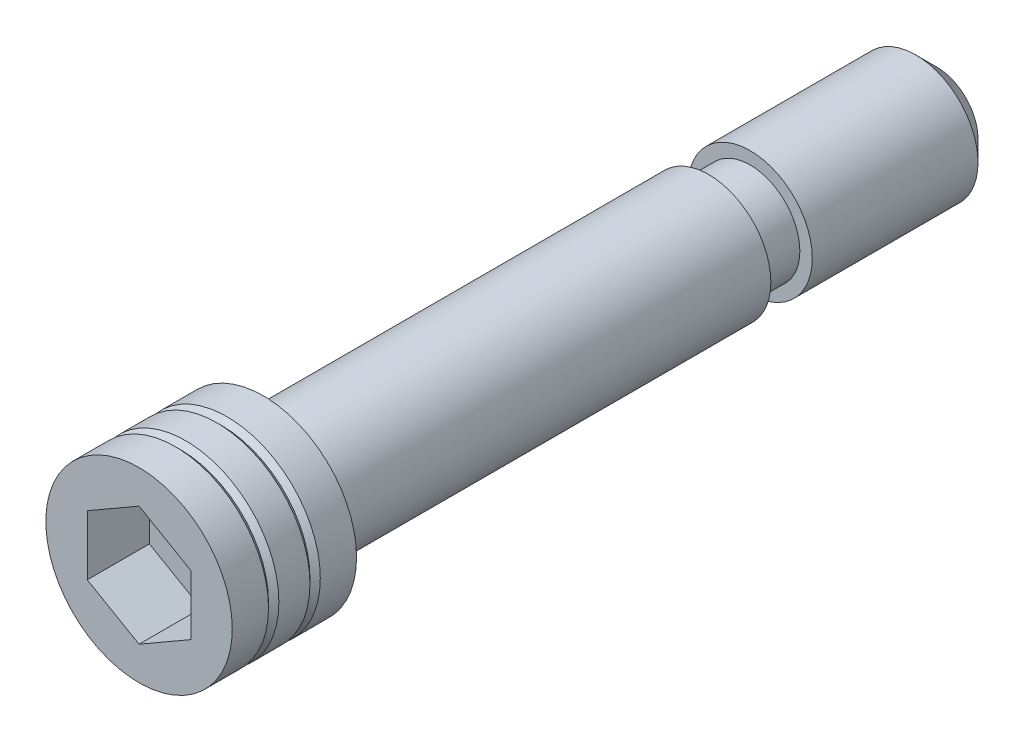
ISO-10303-21;
HEADER;
FILE_DESCRIPTION(('STEP AP214'),'2;1');
FILE_NAME('part.step','',(''),(''),'','','');
FILE_SCHEMA(('AUTOMOTIVE_DESIGN { 1 0 10303 214 1 1 1 1 }'));
ENDSEC;
DATA;
#1=APPLICATION_CONTEXT('core data for automotive mechanical design processes');
#2=APPLICATION_PROTOCOL_DEFINITION('international standard','automotive_design',2000,#1);
#3=PRODUCT_CONTEXT('',#1,'mechanical');
#4=PRODUCT('Part','Part','',(#3));
#5=PRODUCT_RELATED_PRODUCT_CATEGORY('part','',(#4));
#6=PRODUCT_DEFINITION_FORMATION('','',#4);
#7=PRODUCT_DEFINITION_CONTEXT('part definition',#1,'design');
#8=PRODUCT_DEFINITION('design','',#6,#7);
#9=PRODUCT_DEFINITION_SHAPE('','',#8);
#10=(LENGTH_UNIT() NAMED_UNIT(*) SI_UNIT(.MILLI.,.METRE.));
#11=(NAMED_UNIT(*) PLANE_ANGLE_UNIT() SI_UNIT($,.RADIAN.));
#12=(NAMED_UNIT(*) SI_UNIT($,.STERADIAN.) SOLID_ANGLE_UNIT());
#13=UNCERTAINTY_MEASURE_WITH_UNIT(LENGTH_MEASURE(1.E-05),#10,'distance_accuracy_value','');
#14=(GEOMETRIC_REPRESENTATION_CONTEXT(3) GLOBAL_UNCERTAINTY_ASSIGNED_CONTEXT((#13)) GLOBAL_UNIT_ASSIGNED_CONTEXT((#10,
#11,#12)) REPRESENTATION_CONTEXT('',''));
#15=CARTESIAN_POINT('',(0.,0.,0.));
#16=DIRECTION('',(0.,0.,1.));
#17=DIRECTION('',(1.,0.,0.));
#18=AXIS2_PLACEMENT_3D('',#15,#16,#17);
#19=CARTESIAN_POINT('',(0.,0.,15.));
#20=DIRECTION('',(0.,0.,1.));
#21=DIRECTION('',(1.,0.,0.));
#22=AXIS2_PLACEMENT_3D('',#19,#20,#21);
#23=CYLINDRICAL_SURFACE('',#22,9.);
#24=CARTESIAN_POINT('',(0.,0.,0.));
#25=DIRECTION('',(0.,0.,1.));
#26=DIRECTION('',(1.,0.,0.));
#27=AXIS2_PLACEMENT_3D('',#24,#25,#26);
#28=CIRCLE('',#27,9.);
#29=CARTESIAN_POINT('',(9.,0.,0.));
#30=VERTEX_POINT('',#29);
#31=EDGE_CURVE('E128',#30,#30,#28,.T.);
#32=ORIENTED_EDGE('',*,*,#31,.T.);
#33=EDGE_LOOP('',(#32));
#34=FACE_BOUND('',#33,.T.);
#35=CARTESIAN_POINT('',(0.,0.,3.5));
#36=DIRECTION('',(0.,0.,-1.));
#37=DIRECTION('',(-1.,0.,0.));
#38=AXIS2_PLACEMENT_3D('',#35,#36,#37);
#39=CIRCLE('',#38,9.);
#40=CARTESIAN_POINT('',(-9.,0.,3.5));
#41=VERTEX_POINT('',#40);
#42=EDGE_CURVE('E18',#41,#41,#39,.F.);
#43=ORIENTED_EDGE('',*,*,#42,.F.);
#44=EDGE_LOOP('',(#43));
#45=FACE_BOUND('',#44,.T.);
#46=ADVANCED_FACE('F14',(#34,#45),#23,.T.);
#47=CARTESIAN_POINT('',(0.,0.,-65.));
#48=DIRECTION('',(0.,0.,1.));
#49=DIRECTION('',(1.,0.,0.));
#50=AXIS2_PLACEMENT_3D('',#47,#48,#49);
#51=PLANE('',#50);
#52=CARTESIAN_POINT('',(0.,0.,-65.));
#53=DIRECTION('',(0.,0.,1.));
#54=DIRECTION('',(1.,0.,0.));
#55=AXIS2_PLACEMENT_3D('',#52,#53,#54);
#56=CIRCLE('',#55,4.);
#57=CARTESIAN_POINT('',(4.,0.,-65.));
#58=VERTEX_POINT('',#57);
#59=EDGE_CURVE('E9',#58,#58,#56,.T.);
#60=ORIENTED_EDGE('',*,*,#59,.F.);
#61=EDGE_LOOP('',(#60));
#62=FACE_BOUND('',#61,.T.);
#63=ADVANCED_FACE('F16',(#62),#51,.F.);
#64=CARTESIAN_POINT('',(0.,0.,-65.));
#65=DIRECTION('',(0.,0.,1.));
#66=DIRECTION('',(1.,0.,0.));
#67=AXIS2_PLACEMENT_3D('',#64,#65,#66);
#68=CONICAL_SURFACE('',#67,4.,0.785398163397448);
#69=CARTESIAN_POINT('',(0.,0.,-63.));
#70=DIRECTION('',(0.,0.,1.));
#71=DIRECTION('',(1.,0.,0.));
#72=AXIS2_PLACEMENT_3D('',#69,#70,#71);
#73=CIRCLE('',#72,6.);
#74=CARTESIAN_POINT('',(6.,0.,-63.));
#75=VERTEX_POINT('',#74);
#76=EDGE_CURVE('E23',#75,#75,#73,.T.);
#77=ORIENTED_EDGE('',*,*,#76,.F.);
#78=EDGE_LOOP('',(#77));
#79=FACE_BOUND('',#78,.T.);
#80=ORIENTED_EDGE('',*,*,#59,.T.);
#81=EDGE_LOOP('',(#80));
#82=FACE_BOUND('',#81,.T.);
#83=ADVANCED_FACE('F283',(#79,#82),#68,.T.);
#84=CARTESIAN_POINT('',(0.,0.,15.));
#85=DIRECTION('',(0.,0.,1.));
#86=DIRECTION('',(1.,0.,0.));
#87=AXIS2_PLACEMENT_3D('',#84,#85,#86);
#88=CYLINDRICAL_SURFACE('',#87,6.);
#89=CARTESIAN_POINT('',(0.,0.,-47.));
#90=DIRECTION('',(0.,0.,1.));
#91=DIRECTION('',(1.,0.,0.));
#92=AXIS2_PLACEMENT_3D('',#89,#90,#91);
#93=CIRCLE('',#92,6.);
#94=CARTESIAN_POINT('',(6.,0.,-47.));
#95=VERTEX_POINT('',#94);
#96=EDGE_CURVE('E143',#95,#95,#93,.T.);
#97=ORIENTED_EDGE('',*,*,#96,.F.);
#98=EDGE_LOOP('',(#97));
#99=FACE_BOUND('',#98,.T.);
#100=ORIENTED_EDGE('',*,*,#76,.T.);
#101=EDGE_LOOP('',(#100));
#102=FACE_BOUND('',#101,.T.);
#103=ADVANCED_FACE('F292',(#99,#102),#88,.T.);
#104=CARTESIAN_POINT('',(-6.,0.,-47.));
#105=DIRECTION('',(0.,0.,-1.));
#106=DIRECTION('',(-1.,0.,0.));
#107=AXIS2_PLACEMENT_3D('',#104,#105,#106);
#108=PLANE('',#107);
#109=CARTESIAN_POINT('',(0.,0.,-47.));
#110=DIRECTION('',(0.,0.,1.));
#111=DIRECTION('',(1.,0.,0.));
#112=AXIS2_PLACEMENT_3D('',#109,#110,#111);
#113=CIRCLE('',#112,4.8);
#114=CARTESIAN_POINT('',(4.8,0.,-47.));
#115=VERTEX_POINT('',#114);
#116=EDGE_CURVE('E140',#115,#115,#113,.T.);
#117=ORIENTED_EDGE('',*,*,#116,.F.);
#118=EDGE_LOOP('',(#117));
#119=FACE_BOUND('',#118,.T.);
#120=ORIENTED_EDGE('',*,*,#96,.T.);
#121=EDGE_LOOP('',(#120));
#122=FACE_BOUND('',#121,.T.);
#123=ADVANCED_FACE('F301',(#119,#122),#108,.F.);
#124=CARTESIAN_POINT('',(0.,0.,15.));
#125=DIRECTION('',(0.,0.,1.));
#126=DIRECTION('',(1.,0.,0.));
#127=AXIS2_PLACEMENT_3D('',#124,#125,#126);
#128=CYLINDRICAL_SURFACE('',#127,4.8);
#129=CARTESIAN_POINT('',(0.,0.,-43.));
#130=DIRECTION('',(0.,0.,1.));
#131=DIRECTION('',(1.,0.,0.));
#132=AXIS2_PLACEMENT_3D('',#129,#130,#131);
#133=CIRCLE('',#132,4.8);
#134=CARTESIAN_POINT('',(4.8,0.,-43.));
#135=VERTEX_POINT('',#134);
#136=EDGE_CURVE('E137',#135,#135,#133,.T.);
#137=ORIENTED_EDGE('',*,*,#136,.F.);
#138=EDGE_LOOP('',(#137));
#139=FACE_BOUND('',#138,.T.);
#140=ORIENTED_EDGE('',*,*,#116,.T.);
#141=EDGE_LOOP('',(#140));
#142=FACE_BOUND('',#141,.T.);
#143=ADVANCED_FACE('F311',(#139,#142),#128,.T.);
#144=CARTESIAN_POINT('',(-4.8,0.,-43.));
#145=DIRECTION('',(0.,0.,1.));
#146=DIRECTION('',(1.,0.,0.));
#147=AXIS2_PLACEMENT_3D('',#144,#145,#146);
#148=PLANE('',#147);
#149=CARTESIAN_POINT('',(0.,0.,-43.));
#150=DIRECTION('',(0.,0.,1.));
#151=DIRECTION('',(1.,0.,0.));
#152=AXIS2_PLACEMENT_3D('',#149,#150,#151);
#153=CIRCLE('',#152,6.);
#154=CARTESIAN_POINT('',(6.,0.,-43.));
#155=VERTEX_POINT('',#154);
#156=EDGE_CURVE('E134',#155,#155,#153,.T.);
#157=ORIENTED_EDGE('',*,*,#156,.F.);
#158=EDGE_LOOP('',(#157));
#159=FACE_BOUND('',#158,.T.);
#160=ORIENTED_EDGE('',*,*,#136,.T.);
#161=EDGE_LOOP('',(#160));
#162=FACE_BOUND('',#161,.T.);
#163=ADVANCED_FACE('F321',(#159,#162),#148,.F.);
#164=CARTESIAN_POINT('',(0.,0.,15.));
#165=DIRECTION('',(0.,0.,1.));
#166=DIRECTION('',(1.,0.,0.));
#167=AXIS2_PLACEMENT_3D('',#164,#165,#166);
#168=CYLINDRICAL_SURFACE('',#167,6.);
#169=CARTESIAN_POINT('',(0.,0.,0.));
#170=DIRECTION('',(0.,0.,1.));
#171=DIRECTION('',(1.,0.,0.));
#172=AXIS2_PLACEMENT_3D('',#169,#170,#171);
#173=CIRCLE('',#172,6.);
#174=CARTESIAN_POINT('',(6.,0.,0.));
#175=VERTEX_POINT('',#174);
#176=EDGE_CURVE('E131',#175,#175,#173,.T.);
#177=ORIENTED_EDGE('',*,*,#176,.F.);
#178=EDGE_LOOP('',(#177));
#179=FACE_BOUND('',#178,.T.);
#180=ORIENTED_EDGE('',*,*,#156,.T.);
#181=EDGE_LOOP('',(#180));
#182=FACE_BOUND('',#181,.T.);
#183=ADVANCED_FACE('F331',(#179,#182),#168,.T.);
#184=CARTESIAN_POINT('',(-6.,0.,0.));
#185=DIRECTION('',(0.,0.,1.));
#186=DIRECTION('',(1.,0.,0.));
#187=AXIS2_PLACEMENT_3D('',#184,#185,#186);
#188=PLANE('',#187);
#189=ORIENTED_EDGE('',*,*,#31,.F.);
#190=EDGE_LOOP('',(#189));
#191=FACE_BOUND('',#190,.T.);
#192=ORIENTED_EDGE('',*,*,#176,.T.);
#193=EDGE_LOOP('',(#192));
#194=FACE_BOUND('',#193,.T.);
#195=ADVANCED_FACE('F341',(#191,#194),#188,.F.);
#196=CARTESIAN_POINT('',(0.,0.,2.76239108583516));
#197=DIRECTION('',(0.,0.,-1.));
#198=DIRECTION('',(-1.,0.,0.));
#199=AXIS2_PLACEMENT_3D('',#196,#197,#198);
#200=CONICAL_SURFACE('',#199,9.73760891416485,0.785398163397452);
#201=CARTESIAN_POINT('',(0.,0.,4.));
#202=DIRECTION('',(0.,0.,-1.));
#203=DIRECTION('',(-1.,0.,0.));
#204=AXIS2_PLACEMENT_3D('',#201,#202,#203);
#205=CIRCLE('',#204,8.5);
#206=CARTESIAN_POINT('',(-8.5,0.,4.));
#207=VERTEX_POINT('',#206);
#208=EDGE_CURVE('E156',#207,#207,#205,.T.);
#209=ORIENTED_EDGE('',*,*,#208,.T.);
#210=EDGE_LOOP('',(#209));
#211=FACE_BOUND('',#210,.T.);
#212=ORIENTED_EDGE('',*,*,#42,.T.);
#213=EDGE_LOOP('',(#212));
#214=FACE_BOUND('',#213,.T.);
#215=ADVANCED_FACE('F202',(#211,#214),#200,.T.);
#216=CARTESIAN_POINT('',(0.,0.,4.));
#217=DIRECTION('',(0.,0.,1.));
#218=DIRECTION('',(1.,0.,0.));
#219=AXIS2_PLACEMENT_3D('',#216,#217,#218);
#220=CONICAL_SURFACE('',#219,8.5,0.785398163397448);
#221=ORIENTED_EDGE('',*,*,#208,.F.);
#222=EDGE_LOOP('',(#221));
#223=FACE_BOUND('',#222,.T.);
#224=CARTESIAN_POINT('',(0.,0.,4.5));
#225=DIRECTION('',(0.,0.,1.));
#226=DIRECTION('',(1.,0.,0.));
#227=AXIS2_PLACEMENT_3D('',#224,#225,#226);
#228=CIRCLE('',#227,9.);
#229=CARTESIAN_POINT('',(9.,0.,4.5));
#230=VERTEX_POINT('',#229);
#231=EDGE_CURVE('E154',#230,#230,#228,.F.);
#232=ORIENTED_EDGE('',*,*,#231,.T.);
#233=EDGE_LOOP('',(#232));
#234=FACE_BOUND('',#233,.T.);
#235=ADVANCED_FACE('F208',(#223,#234),#220,.T.);
#236=CARTESIAN_POINT('',(5.,2.88675134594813,6.));
#237=DIRECTION('',(0.,0.,-1.));
#238=DIRECTION('',(-1.,0.,0.));
#239=AXIS2_PLACEMENT_3D('',#236,#237,#238);
#240=PLANE('',#239);
#241=DIRECTION('',(-0.866025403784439,0.5,0.));
#242=VECTOR('',#241,1.);
#243=CARTESIAN_POINT('',(5.,2.88675134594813,6.));
#244=LINE('',#243,#242);
#245=CARTESIAN_POINT('',(5.,2.88675134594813,6.));
#246=VERTEX_POINT('',#245);
#247=CARTESIAN_POINT('',(0.,5.77350269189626,6.));
#248=VERTEX_POINT('',#247);
#249=EDGE_CURVE('E103',#246,#248,#244,.T.);
#250=ORIENTED_EDGE('',*,*,#249,.T.);
#251=DIRECTION('',(-0.866025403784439,-0.5,0.));
#252=VECTOR('',#251,1.);
#253=CARTESIAN_POINT('',(0.,5.77350269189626,6.));
#254=LINE('',#253,#252);
#255=CARTESIAN_POINT('',(-5.,2.88675134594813,6.));
#256=VERTEX_POINT('',#255);
#257=EDGE_CURVE('E106',#248,#256,#254,.T.);
#258=ORIENTED_EDGE('',*,*,#257,.T.);
#259=DIRECTION('',(0.,-1.,0.));
#260=VECTOR('',#259,1.);
#261=CARTESIAN_POINT('',(-5.,2.88675134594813,6.));
#262=LINE('',#261,#260);
#263=CARTESIAN_POINT('',(-5.,-2.88675134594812,6.));
#264=VERTEX_POINT('',#263);
#265=EDGE_CURVE('E77',#256,#264,#262,.T.);
#266=ORIENTED_EDGE('',*,*,#265,.T.);
#267=DIRECTION('',(0.866025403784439,-0.5,0.));
#268=VECTOR('',#267,1.);
#269=CARTESIAN_POINT('',(-5.,-2.88675134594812,6.));
#270=LINE('',#269,#268);
#271=CARTESIAN_POINT('',(0.,-5.77350269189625,6.));
#272=VERTEX_POINT('',#271);
#273=EDGE_CURVE('E109',#264,#272,#270,.T.);
#274=ORIENTED_EDGE('',*,*,#273,.T.);
#275=DIRECTION('',(0.866025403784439,0.5,0.));
#276=VECTOR('',#275,1.);
#277=CARTESIAN_POINT('',(0.,-5.77350269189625,6.));
#278=LINE('',#277,#276);
#279=CARTESIAN_POINT('',(5.,-2.88675134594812,6.));
#280=VERTEX_POINT('',#279);
#281=EDGE_CURVE('E112',#272,#280,#278,.T.);
#282=ORIENTED_EDGE('',*,*,#281,.T.);
#283=DIRECTION('',(0.,1.,0.));
#284=VECTOR('',#283,1.);
#285=CARTESIAN_POINT('',(5.,-2.88675134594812,6.));
#286=LINE('',#285,#284);
#287=EDGE_CURVE('E115',#280,#246,#286,.T.);
#288=ORIENTED_EDGE('',*,*,#287,.T.);
#289=EDGE_LOOP('',(#250,#258,#266,#274,#282,#288));
#290=FACE_BOUND('',#289,.T.);
#291=ADVANCED_FACE('F205',(#290),#240,.F.);
#292=CARTESIAN_POINT('',(-5.,2.88675134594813,6.));
#293=DIRECTION('',(-1.,0.,0.));
#294=DIRECTION('',(0.,0.,1.));
#295=AXIS2_PLACEMENT_3D('',#292,#293,#294);
#296=PLANE('',#295);
#297=DIRECTION('',(0.,-1.,0.));
#298=VECTOR('',#297,1.);
#299=CARTESIAN_POINT('',(-5.,2.88675134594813,12.));
#300=LINE('',#299,#298);
#301=CARTESIAN_POINT('',(-5.,2.88675134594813,12.));
#302=VERTEX_POINT('',#301);
#303=CARTESIAN_POINT('',(-5.,-2.88675134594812,12.));
#304=VERTEX_POINT('',#303);
#305=EDGE_CURVE('E74',#302,#304,#300,.T.);
#306=ORIENTED_EDGE('',*,*,#305,.T.);
#307=DIRECTION('',(0.,0.,1.));
#308=VECTOR('',#307,1.);
#309=CARTESIAN_POINT('',(-5.,-2.88675134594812,6.));
#310=LINE('',#309,#308);
#311=EDGE_CURVE('E81',#264,#304,#310,.T.);
#312=ORIENTED_EDGE('',*,*,#311,.F.);
#313=ORIENTED_EDGE('',*,*,#265,.F.);
#314=DIRECTION('',(0.,0.,1.));
#315=VECTOR('',#314,1.);
#316=CARTESIAN_POINT('',(-5.,2.88675134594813,6.));
#317=LINE('',#316,#315);
#318=EDGE_CURVE('E70',#256,#302,#317,.T.);
#319=ORIENTED_EDGE('',*,*,#318,.T.);
#320=EDGE_LOOP('',(#306,#312,#313,#319));
#321=FACE_BOUND('',#320,.T.);
#322=ADVANCED_FACE('F72',(#321),#296,.F.);
#323=CARTESIAN_POINT('',(-5.,-2.88675134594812,6.));
#324=DIRECTION('',(-0.5,-0.866025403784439,0.));
#325=DIRECTION('',(0.866025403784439,-0.5,0.));
#326=AXIS2_PLACEMENT_3D('',#323,#324,#325);
#327=PLANE('',#326);
#328=DIRECTION('',(0.866025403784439,-0.5,0.));
#329=VECTOR('',#328,1.);
#330=CARTESIAN_POINT('',(-5.,-2.88675134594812,12.));
#331=LINE('',#330,#329);
#332=CARTESIAN_POINT('',(0.,-5.77350269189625,12.));
#333=VERTEX_POINT('',#332);
#334=EDGE_CURVE('E93',#304,#333,#331,.T.);
#335=ORIENTED_EDGE('',*,*,#334,.T.);
#336=DIRECTION('',(0.,0.,1.));
#337=VECTOR('',#336,1.);
#338=CARTESIAN_POINT('',(0.,-5.77350269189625,6.));
#339=LINE('',#338,#337);
#340=EDGE_CURVE('E122',#272,#333,#339,.T.);
#341=ORIENTED_EDGE('',*,*,#340,.F.);
#342=ORIENTED_EDGE('',*,*,#273,.F.);
#343=ORIENTED_EDGE('',*,*,#311,.T.);
#344=EDGE_LOOP('',(#335,#341,#342,#343));
#345=FACE_BOUND('',#344,.T.);
#346=ADVANCED_FACE('F217',(#345),#327,.F.);
#347=CARTESIAN_POINT('',(0.,-5.77350269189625,6.));
#348=DIRECTION('',(0.5,-0.866025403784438,0.));
#349=DIRECTION('',(0.866025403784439,0.5,0.));
#350=AXIS2_PLACEMENT_3D('',#347,#348,#349);
#351=PLANE('',#350);
#352=DIRECTION('',(0.866025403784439,0.5,0.));
#353=VECTOR('',#352,1.);
#354=CARTESIAN_POINT('',(0.,-5.77350269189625,12.));
#355=LINE('',#354,#353);
#356=CARTESIAN_POINT('',(5.,-2.88675134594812,12.));
#357=VERTEX_POINT('',#356);
#358=EDGE_CURVE('E95',#333,#357,#355,.T.);
#359=ORIENTED_EDGE('',*,*,#358,.T.);
#360=DIRECTION('',(0.,0.,1.));
#361=VECTOR('',#360,1.);
#362=CARTESIAN_POINT('',(5.,-2.88675134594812,6.));
#363=LINE('',#362,#361);
#364=EDGE_CURVE('E120',#280,#357,#363,.T.);
#365=ORIENTED_EDGE('',*,*,#364,.F.);
#366=ORIENTED_EDGE('',*,*,#281,.F.);
#367=ORIENTED_EDGE('',*,*,#340,.T.);
#368=EDGE_LOOP('',(#359,#365,#366,#367));
#369=FACE_BOUND('',#368,.T.);
#370=ADVANCED_FACE('F214',(#369),#351,.F.);
#371=CARTESIAN_POINT('',(5.,-2.88675134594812,6.));
#372=DIRECTION('',(1.,0.,0.));
#373=DIRECTION('',(0.,0.,-1.));
#374=AXIS2_PLACEMENT_3D('',#371,#372,#373);
#375=PLANE('',#374);
#376=DIRECTION('',(0.,1.,0.));
#377=VECTOR('',#376,1.);
#378=CARTESIAN_POINT('',(5.,-2.88675134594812,12.));
#379=LINE('',#378,#377);
#380=CARTESIAN_POINT('',(5.,2.88675134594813,12.));
#381=VERTEX_POINT('',#380);
#382=EDGE_CURVE('E101',#357,#381,#379,.T.);
#383=ORIENTED_EDGE('',*,*,#382,.T.);
#384=DIRECTION('',(0.,0.,1.));
#385=VECTOR('',#384,1.);
#386=CARTESIAN_POINT('',(5.,2.88675134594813,6.));
#387=LINE('',#386,#385);
#388=EDGE_CURVE('E38',#246,#381,#387,.T.);
#389=ORIENTED_EDGE('',*,*,#388,.F.);
#390=ORIENTED_EDGE('',*,*,#287,.F.);
#391=ORIENTED_EDGE('',*,*,#364,.T.);
#392=EDGE_LOOP('',(#383,#389,#390,#391));
#393=FACE_BOUND('',#392,.T.);
#394=ADVANCED_FACE('F210',(#393),#375,.F.);
#395=CARTESIAN_POINT('',(5.,2.88675134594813,6.));
#396=DIRECTION('',(0.5,0.866025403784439,0.));
#397=DIRECTION('',(-0.866025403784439,0.5,0.));
#398=AXIS2_PLACEMENT_3D('',#395,#396,#397);
#399=PLANE('',#398);
#400=DIRECTION('',(-0.866025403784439,0.5,0.));
#401=VECTOR('',#400,1.);
#402=CARTESIAN_POINT('',(5.,2.88675134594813,12.));
#403=LINE('',#402,#401);
#404=CARTESIAN_POINT('',(0.,5.77350269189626,12.));
#405=VERTEX_POINT('',#404);
#406=EDGE_CURVE('E31',#381,#405,#403,.T.);
#407=ORIENTED_EDGE('',*,*,#406,.T.);
#408=DIRECTION('',(0.,0.,1.));
#409=VECTOR('',#408,1.);
#410=CARTESIAN_POINT('',(0.,5.77350269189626,6.));
#411=LINE('',#410,#409);
#412=EDGE_CURVE('E82',#248,#405,#411,.T.);
#413=ORIENTED_EDGE('',*,*,#412,.F.);
#414=ORIENTED_EDGE('',*,*,#249,.F.);
#415=ORIENTED_EDGE('',*,*,#388,.T.);
#416=EDGE_LOOP('',(#407,#413,#414,#415));
#417=FACE_BOUND('',#416,.T.);
#418=ADVANCED_FACE('F213',(#417),#399,.F.);
#419=CARTESIAN_POINT('',(0.,5.77350269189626,6.));
#420=DIRECTION('',(-0.5,0.866025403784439,0.));
#421=DIRECTION('',(-0.866025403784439,-0.5,0.));
#422=AXIS2_PLACEMENT_3D('',#419,#420,#421);
#423=PLANE('',#422);
#424=DIRECTION('',(-0.866025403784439,-0.5,0.));
#425=VECTOR('',#424,1.);
#426=CARTESIAN_POINT('',(0.,5.77350269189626,12.));
#427=LINE('',#426,#425);
#428=EDGE_CURVE('E85',#405,#302,#427,.T.);
#429=ORIENTED_EDGE('',*,*,#428,.T.);
#430=ORIENTED_EDGE('',*,*,#318,.F.);
#431=ORIENTED_EDGE('',*,*,#257,.F.);
#432=ORIENTED_EDGE('',*,*,#412,.T.);
#433=EDGE_LOOP('',(#429,#430,#431,#432));
#434=FACE_BOUND('',#433,.T.);
#435=ADVANCED_FACE('F86',(#434),#423,.F.);
#436=CARTESIAN_POINT('',(-9.,0.,12.));
#437=DIRECTION('',(0.,0.,-1.));
#438=DIRECTION('',(-1.,0.,0.));
#439=AXIS2_PLACEMENT_3D('',#436,#437,#438);
#440=PLANE('',#439);
#441=ORIENTED_EDGE('',*,*,#428,.F.);
#442=ORIENTED_EDGE('',*,*,#406,.F.);
#443=ORIENTED_EDGE('',*,*,#382,.F.);
#444=ORIENTED_EDGE('',*,*,#358,.F.);
#445=ORIENTED_EDGE('',*,*,#334,.F.);
#446=ORIENTED_EDGE('',*,*,#305,.F.);
#447=EDGE_LOOP('',(#441,#442,#443,#444,#445,#446));
#448=FACE_BOUND('',#447,.T.);
#449=CARTESIAN_POINT('',(0.,0.,12.));
#450=DIRECTION('',(0.,0.,1.));
#451=DIRECTION('',(1.,0.,0.));
#452=AXIS2_PLACEMENT_3D('',#449,#450,#451);
#453=CIRCLE('',#452,9.);
#454=CARTESIAN_POINT('',(9.,0.,12.));
#455=VERTEX_POINT('',#454);
#456=EDGE_CURVE('E119',#455,#455,#453,.T.);
#457=ORIENTED_EDGE('',*,*,#456,.T.);
#458=EDGE_LOOP('',(#457));
#459=FACE_BOUND('',#458,.T.);
#460=ADVANCED_FACE('F89',(#448,#459),#440,.F.);
#461=ORIENTED_EDGE('',*,*,#456,.F.);
#462=EDGE_LOOP('',(#461));
#463=FACE_BOUND('',#462,.T.);
#464=CARTESIAN_POINT('',(0.,0.,8.5));
#465=DIRECTION('',(0.,0.,1.));
#466=DIRECTION('',(1.,0.,0.));
#467=AXIS2_PLACEMENT_3D('',#464,#465,#466);
#468=CIRCLE('',#467,9.);
#469=CARTESIAN_POINT('',(9.,0.,8.5));
#470=VERTEX_POINT('',#469);
#471=EDGE_CURVE('E151',#470,#470,#468,.F.);
#472=ORIENTED_EDGE('',*,*,#471,.F.);
#473=EDGE_LOOP('',(#472));
#474=FACE_BOUND('',#473,.T.);
#475=ADVANCED_FACE('F174',(#463,#474),#23,.T.);
#476=CARTESIAN_POINT('',(0.,0.,8.));
#477=DIRECTION('',(0.,0.,1.));
#478=DIRECTION('',(1.,0.,0.));
#479=AXIS2_PLACEMENT_3D('',#476,#477,#478);
#480=CONICAL_SURFACE('',#479,8.5,0.785398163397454);
#481=CARTESIAN_POINT('',(0.,0.,8.));
#482=DIRECTION('',(0.,0.,-1.));
#483=DIRECTION('',(-1.,0.,0.));
#484=AXIS2_PLACEMENT_3D('',#481,#482,#483);
#485=CIRCLE('',#484,8.5);
#486=CARTESIAN_POINT('',(-8.5,0.,8.));
#487=VERTEX_POINT('',#486);
#488=EDGE_CURVE('E152',#487,#487,#485,.T.);
#489=ORIENTED_EDGE('',*,*,#488,.F.);
#490=EDGE_LOOP('',(#489));
#491=FACE_BOUND('',#490,.T.);
#492=ORIENTED_EDGE('',*,*,#471,.T.);
#493=EDGE_LOOP('',(#492));
#494=FACE_BOUND('',#493,.T.);
#495=ADVANCED_FACE('F171',(#491,#494),#480,.T.);
#496=CARTESIAN_POINT('',(0.,0.,6.76239108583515));
#497=DIRECTION('',(0.,0.,-1.));
#498=DIRECTION('',(-1.,0.,0.));
#499=AXIS2_PLACEMENT_3D('',#496,#497,#498);
#500=CONICAL_SURFACE('',#499,9.73760891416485,0.785398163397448);
#501=ORIENTED_EDGE('',*,*,#488,.T.);
#502=EDGE_LOOP('',(#501));
#503=FACE_BOUND('',#502,.T.);
#504=CARTESIAN_POINT('',(0.,0.,7.5));
#505=DIRECTION('',(0.,0.,-1.));
#506=DIRECTION('',(-1.,0.,0.));
#507=AXIS2_PLACEMENT_3D('',#504,#505,#506);
#508=CIRCLE('',#507,9.);
#509=CARTESIAN_POINT('',(-9.,0.,7.5));
#510=VERTEX_POINT('',#509);
#511=EDGE_CURVE('E148',#510,#510,#508,.F.);
#512=ORIENTED_EDGE('',*,*,#511,.T.);
#513=EDGE_LOOP('',(#512));
#514=FACE_BOUND('',#513,.T.);
#515=ADVANCED_FACE('F168',(#503,#514),#500,.T.);
#516=ORIENTED_EDGE('',*,*,#511,.F.);
#517=EDGE_LOOP('',(#516));
#518=FACE_BOUND('',#517,.T.);
#519=ORIENTED_EDGE('',*,*,#231,.F.);
#520=EDGE_LOOP('',(#519));
#521=FACE_BOUND('',#520,.T.);
#522=ADVANCED_FACE('F181',(#518,#521),#23,.T.);
#523=CLOSED_SHELL('',(#46,#63,#83,#103,#123,#143,#163,#183,#195,#215,#235,#291,#322,#346,#370,
#394,#418,#435,#460,#475,#495,#515,#522));
#524=MANIFOLD_SOLID_BREP('B1',#523);
#525=ADVANCED_BREP_SHAPE_REPRESENTATION('',(#18,#524),#14);
#526=SHAPE_DEFINITION_REPRESENTATION(#9,#525);
ENDSEC;
END-ISO-10303-21;
